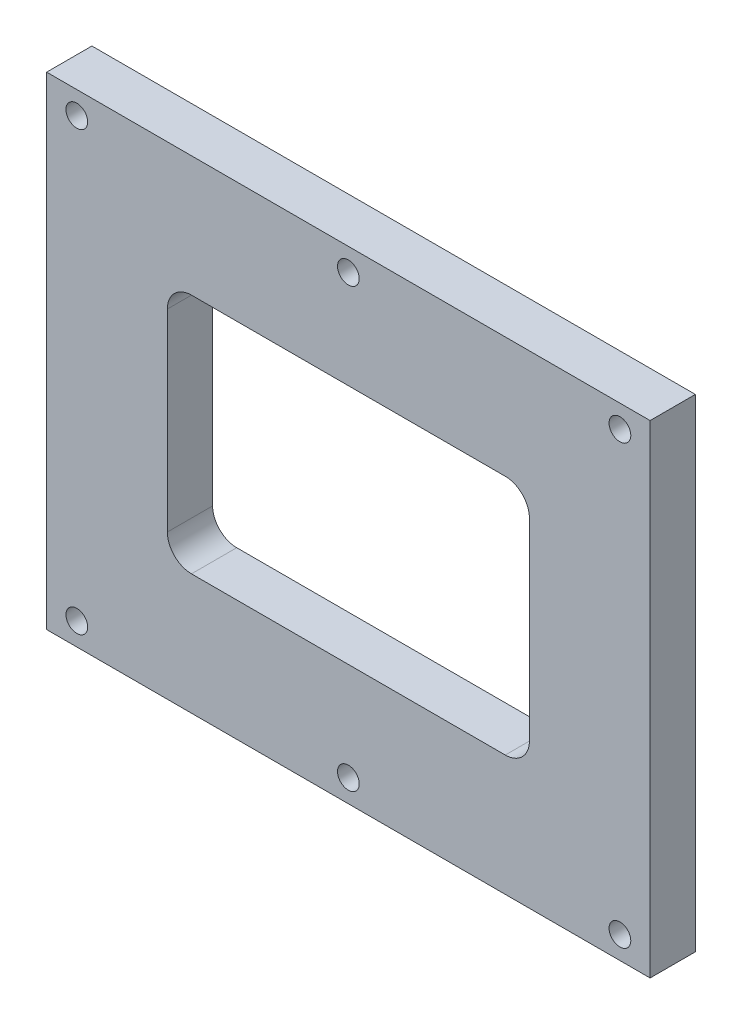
from build123d import *

# Parameters (mm, degrees)
SKETCH1_W           = 63.5
SKETCH1_H           = 50.8
BOSS_EXTRUDE1_DEPTH = 4.7625
SKETCH2_R           = 1.143
CUT_EXTRUDE1_DEPTH  = 41.937805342
SKETCH3_W           = 38.1
SKETCH3_H           = 25.4
CUT_EXTRUDE2_DEPTH  = 41.937805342
FILLET1_R           = 2.54


with BuildPart() as part:
    # Sketch1 → Boss-Extrude1 (new body)
    with BuildSketch(Plane.XY):
        Rectangle(SKETCH1_W, SKETCH1_H)
    extrude(amount=BOSS_EXTRUDE1_DEPTH)

    # Sketch2 → Cut-Extrude1 (cut, through all)
    with BuildSketch(Plane.XY.offset(4.7625)):
        with Locations((-28.575, -23.01875)):
            Circle(SKETCH2_R)
        with Locations((28.575, -23.01875)):
            Circle(SKETCH2_R)
        with Locations((0, -23.01875)):
            Circle(SKETCH2_R)
        with Locations((0, 23.01875)):
            Circle(SKETCH2_R)
        with Locations((28.575, 23.01875)):
            Circle(SKETCH2_R)
        with Locations((-28.575, 23.01875)):
            Circle(SKETCH2_R)
    extrude(amount=-CUT_EXTRUDE1_DEPTH, mode=Mode.SUBTRACT)

    # Sketch3 → Cut-Extrude2 (cut, through all)
    with BuildSketch(Plane.XY.offset(4.7625)):
        Rectangle(SKETCH3_W, SKETCH3_H)
    extrude(amount=-CUT_EXTRUDE2_DEPTH, mode=Mode.SUBTRACT)

    # Fillet1
    fillet1_edges = [part.edges().sort_by_distance(p)[0] for p in [
        (19.05, -12.7, 2.38125),
        (-19.05, -12.7, 2.38125),
        (-19.05, 12.7, 2.38125),
        (19.05, 12.7, 2.38125),
    ]]
    fillet(fillet1_edges, radius=FILLET1_R)


solid = part.part
